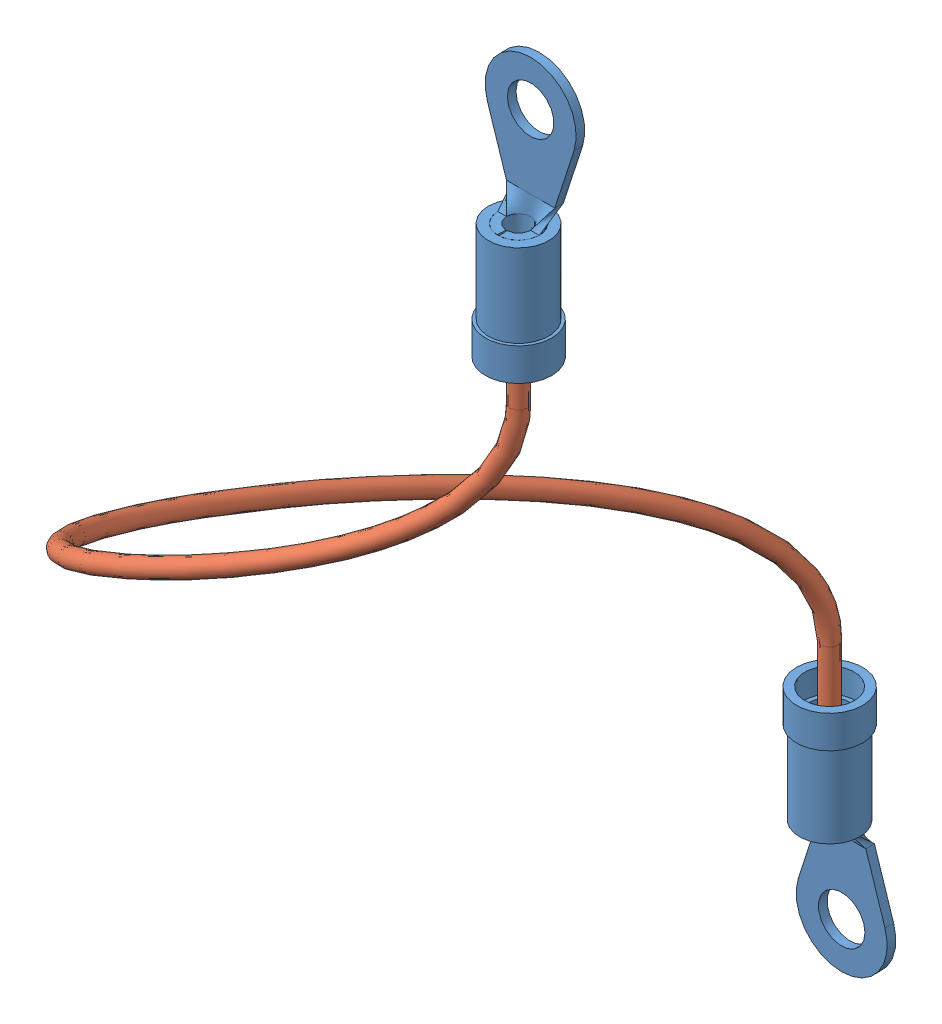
SolidWorks assembly Ring_0-6_10.sldasm, configuration Default (file format 13000). Lengths in mm.
Overall size (53.61 120.14 69.76).
3 component instances, 2 part files, 4 mates.
Components (placement in the parent):
- ring_term_awg-14_10-15: ring_term_awg-14_10.SLDPRT [Default] at (129.032 58.7375 12.2873) x (0 1 0) z (1 0 0) size (27.02 6.1 8.38)
- ring_term_awg-14_10-16: ring_term_awg-14_10.SLDPRT [Default] at (161.925 170.4975 73.8188) x (0 -1 0) z (-1 0 0) size (27.02 6.1 8.38)
- Cable-Ring_0-6_10-1: Cable-Ring_0-6_10.sldprt [Default] at origin size (48.5 86.11 67.52)
Mates (geometry in assembly coordinates):
- Concentric11: concentric: cylinder of assembly through (129.032 58.7375 11.4935) axis (0 0 -1) radius 3.556; cylinder of ring_term_awg-14_10-15 through (129.032 58.7375 11.4935) axis (0 0 1) radius 2.1463; cylinder of ?
- Coincident11: coincident anti-aligned: plane of ring_term_awg-14_10-15 through (129.032 58.7375 11.4935) normal (0 0 -1); plane of assembly through (129.032 58.7375 11.4935) normal (0 0 1)
- Concentric21: concentric: cylinder of assembly through (161.925 170.4975 73.025) axis (0 0 -1) radius 1.27; cylinder of ring_term_awg-14_10-16 through (161.925 170.4975 73.025) axis (0 0 1) radius 2.1463; cylinder of ?
- Coincident21: coincident anti-aligned: plane of ring_term_awg-14_10-16 through (161.925 170.4975 73.025) normal (0 0 -1); plane of assembly through (133.985 154.6225 73.025) normal (0 0 1)
